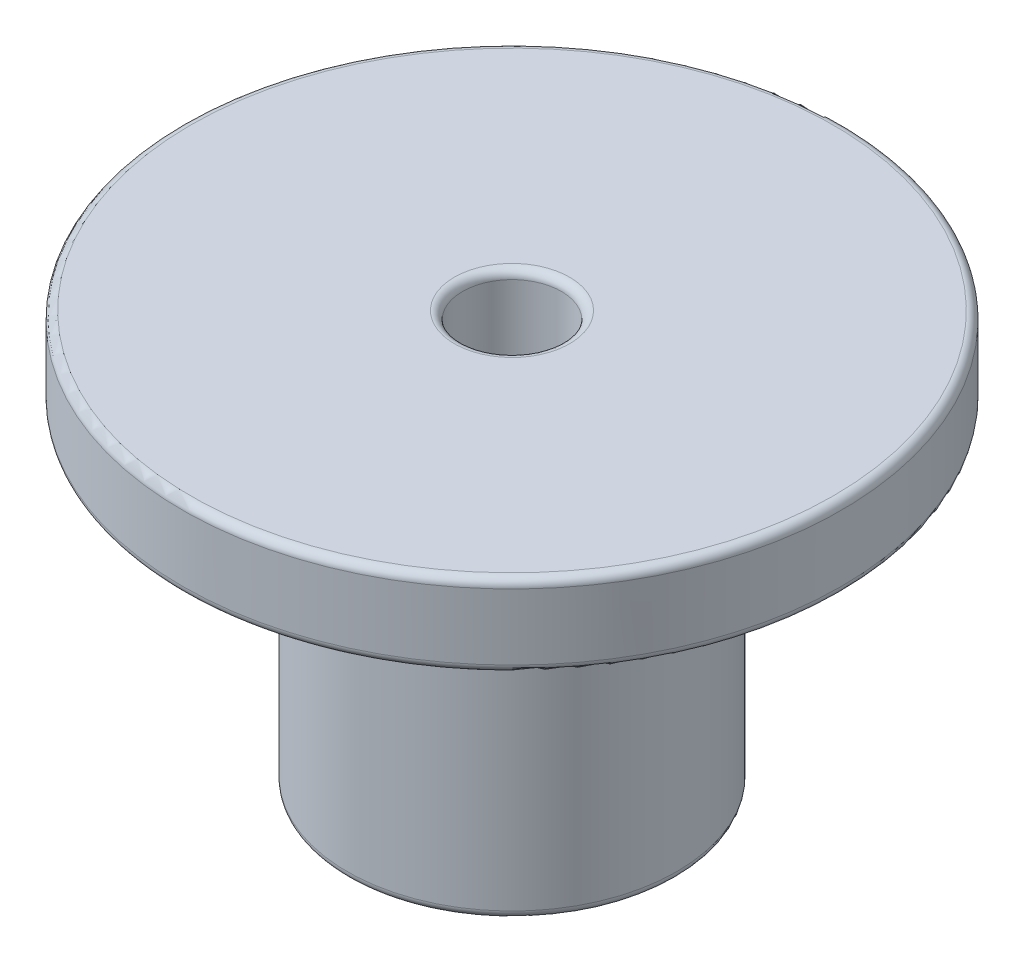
from build123d import *

# Parameters (mm, degrees)
FILLET_1_R = 0.25


with BuildPart() as part:
    # Sketch 1 → Revolve 1 (revolve)
    with BuildSketch(Plane.XY):
        Polygon((-1.5, 0), (-1.5, -12.5), (-5, -12.5), (-5, -2.5), (-10, -2.5), (-10, 0), align=None)
    revolve(axis=Axis((0, 0, 0), (0, -1, 0)))

    # Fillet 1
    fillet_1_edges = [part.edges().sort_by_distance(p)[0] for p in [
        (10, 0, 0),
        (10, -2.5, 0),
        (5, -2.5, 0),
        (5, -12.5, 0),
        (1.5, -12.5, 0),
        (1.5, 0, 0),
    ]]
    fillet(fillet_1_edges, radius=FILLET_1_R)


solid = part.part
